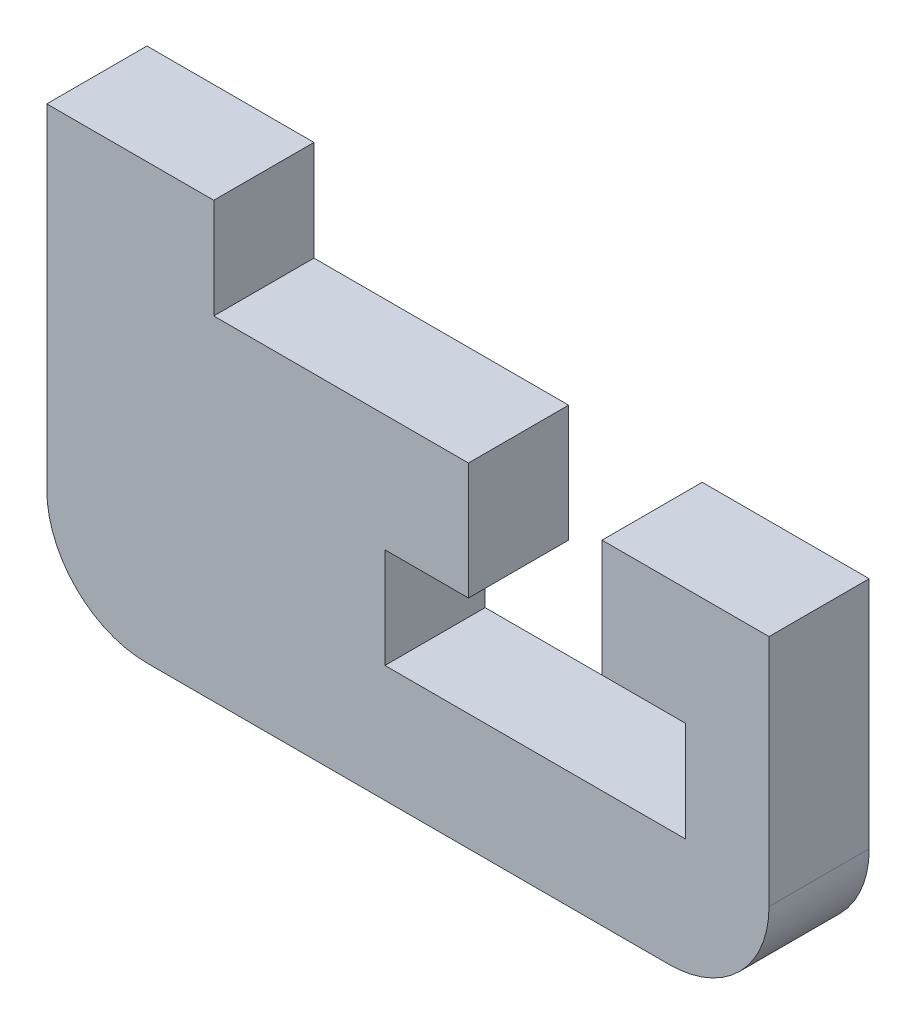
ISO-10303-21;
HEADER;
FILE_DESCRIPTION(('STEP AP214'),'2;1');
FILE_NAME('part.step','',(''),(''),'','','');
FILE_SCHEMA(('AUTOMOTIVE_DESIGN { 1 0 10303 214 1 1 1 1 }'));
ENDSEC;
DATA;
#1=APPLICATION_CONTEXT('core data for automotive mechanical design processes');
#2=APPLICATION_PROTOCOL_DEFINITION('international standard','automotive_design',2000,#1);
#3=PRODUCT_CONTEXT('',#1,'mechanical');
#4=PRODUCT('Part','Part','',(#3));
#5=PRODUCT_RELATED_PRODUCT_CATEGORY('part','',(#4));
#6=PRODUCT_DEFINITION_FORMATION('','',#4);
#7=PRODUCT_DEFINITION_CONTEXT('part definition',#1,'design');
#8=PRODUCT_DEFINITION('design','',#6,#7);
#9=PRODUCT_DEFINITION_SHAPE('','',#8);
#10=(LENGTH_UNIT() NAMED_UNIT(*) SI_UNIT(.MILLI.,.METRE.));
#11=(NAMED_UNIT(*) PLANE_ANGLE_UNIT() SI_UNIT($,.RADIAN.));
#12=(NAMED_UNIT(*) SI_UNIT($,.STERADIAN.) SOLID_ANGLE_UNIT());
#13=UNCERTAINTY_MEASURE_WITH_UNIT(LENGTH_MEASURE(1.E-05),#10,'distance_accuracy_value','');
#14=(GEOMETRIC_REPRESENTATION_CONTEXT(3) GLOBAL_UNCERTAINTY_ASSIGNED_CONTEXT((#13)) GLOBAL_UNIT_ASSIGNED_CONTEXT((#10,
#11,#12)) REPRESENTATION_CONTEXT('',''));
#15=CARTESIAN_POINT('',(0.,0.,0.));
#16=DIRECTION('',(0.,0.,1.));
#17=DIRECTION('',(1.,0.,0.));
#18=AXIS2_PLACEMENT_3D('',#15,#16,#17);
#19=CARTESIAN_POINT('',(-2.,12.0010272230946,3.));
#20=DIRECTION('',(0.,0.,-1.));
#21=DIRECTION('',(-1.,0.,0.));
#22=AXIS2_PLACEMENT_3D('',#19,#20,#21);
#23=CYLINDRICAL_SURFACE('',#22,3.);
#24=CARTESIAN_POINT('',(-2.,12.0010272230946,0.));
#25=DIRECTION('',(0.,0.,1.));
#26=DIRECTION('',(1.,0.,0.));
#27=AXIS2_PLACEMENT_3D('',#24,#25,#26);
#28=CIRCLE('',#27,3.);
#29=CARTESIAN_POINT('',(-5.,12.0010272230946,0.));
#30=VERTEX_POINT('',#29);
#31=CARTESIAN_POINT('',(-1.99999999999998,9.00102722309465,0.));
#32=VERTEX_POINT('',#31);
#33=EDGE_CURVE('E179',#30,#32,#28,.T.);
#34=ORIENTED_EDGE('',*,*,#33,.T.);
#35=DIRECTION('',(0.,0.,-1.));
#36=VECTOR('',#35,1.);
#37=CARTESIAN_POINT('',(-1.99999999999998,9.00102722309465,3.));
#38=LINE('',#37,#36);
#39=CARTESIAN_POINT('',(-1.99999999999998,9.00102722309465,3.));
#40=VERTEX_POINT('',#39);
#41=EDGE_CURVE('E11',#40,#32,#38,.T.);
#42=ORIENTED_EDGE('',*,*,#41,.F.);
#43=CARTESIAN_POINT('',(-2.,12.0010272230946,3.));
#44=DIRECTION('',(0.,0.,1.));
#45=DIRECTION('',(1.,0.,0.));
#46=AXIS2_PLACEMENT_3D('',#43,#44,#45);
#47=CIRCLE('',#46,3.);
#48=CARTESIAN_POINT('',(-5.,12.0010272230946,3.));
#49=VERTEX_POINT('',#48);
#50=EDGE_CURVE('E209',#49,#40,#47,.T.);
#51=ORIENTED_EDGE('',*,*,#50,.F.);
#52=DIRECTION('',(0.,0.,-1.));
#53=VECTOR('',#52,1.);
#54=CARTESIAN_POINT('',(-5.,12.0010272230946,3.));
#55=LINE('',#54,#53);
#56=EDGE_CURVE('E175',#49,#30,#55,.T.);
#57=ORIENTED_EDGE('',*,*,#56,.T.);
#58=EDGE_LOOP('',(#34,#42,#51,#57));
#59=FACE_BOUND('',#58,.T.);
#60=ADVANCED_FACE('F35',(#59),#23,.T.);
#61=CARTESIAN_POINT('',(13.625,9.00102722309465,3.));
#62=DIRECTION('',(0.,1.,0.));
#63=DIRECTION('',(0.,0.,1.));
#64=AXIS2_PLACEMENT_3D('',#61,#62,#63);
#65=PLANE('',#64);
#66=DIRECTION('',(1.,0.,0.));
#67=VECTOR('',#66,1.);
#68=CARTESIAN_POINT('',(13.625,9.00102722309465,0.));
#69=LINE('',#68,#67);
#70=CARTESIAN_POINT('',(13.625,9.00102722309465,0.));
#71=VERTEX_POINT('',#70);
#72=EDGE_CURVE('E182',#32,#71,#69,.T.);
#73=ORIENTED_EDGE('',*,*,#72,.T.);
#74=DIRECTION('',(0.,0.,-1.));
#75=VECTOR('',#74,1.);
#76=CARTESIAN_POINT('',(13.625,9.00102722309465,3.));
#77=LINE('',#76,#75);
#78=CARTESIAN_POINT('',(13.625,9.00102722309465,3.));
#79=VERTEX_POINT('',#78);
#80=EDGE_CURVE('E43',#79,#71,#77,.T.);
#81=ORIENTED_EDGE('',*,*,#80,.F.);
#82=DIRECTION('',(1.,0.,0.));
#83=VECTOR('',#82,1.);
#84=CARTESIAN_POINT('',(13.625,9.00102722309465,3.));
#85=LINE('',#84,#83);
#86=EDGE_CURVE('E118',#40,#79,#85,.T.);
#87=ORIENTED_EDGE('',*,*,#86,.F.);
#88=ORIENTED_EDGE('',*,*,#41,.T.);
#89=EDGE_LOOP('',(#73,#81,#87,#88));
#90=FACE_BOUND('',#89,.T.);
#91=ADVANCED_FACE('F307',(#90),#65,.F.);
#92=CARTESIAN_POINT('',(13.625,12.0010272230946,3.));
#93=DIRECTION('',(0.,0.,-1.));
#94=DIRECTION('',(-1.,0.,0.));
#95=AXIS2_PLACEMENT_3D('',#92,#93,#94);
#96=CYLINDRICAL_SURFACE('',#95,3.);
#97=CARTESIAN_POINT('',(13.625,12.0010272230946,0.));
#98=DIRECTION('',(0.,0.,1.));
#99=DIRECTION('',(-1.,0.,0.));
#100=AXIS2_PLACEMENT_3D('',#97,#98,#99);
#101=CIRCLE('',#100,3.);
#102=CARTESIAN_POINT('',(16.625,12.0010272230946,0.));
#103=VERTEX_POINT('',#102);
#104=EDGE_CURVE('E184',#71,#103,#101,.T.);
#105=ORIENTED_EDGE('',*,*,#104,.T.);
#106=DIRECTION('',(0.,0.,-1.));
#107=VECTOR('',#106,1.);
#108=CARTESIAN_POINT('',(16.625,12.0010272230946,3.));
#109=LINE('',#108,#107);
#110=CARTESIAN_POINT('',(16.625,12.0010272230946,3.));
#111=VERTEX_POINT('',#110);
#112=EDGE_CURVE('E240',#111,#103,#109,.T.);
#113=ORIENTED_EDGE('',*,*,#112,.F.);
#114=CARTESIAN_POINT('',(13.625,12.0010272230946,3.));
#115=DIRECTION('',(0.,0.,1.));
#116=DIRECTION('',(-1.,0.,0.));
#117=AXIS2_PLACEMENT_3D('',#114,#115,#116);
#118=CIRCLE('',#117,3.);
#119=EDGE_CURVE('E248',#79,#111,#118,.T.);
#120=ORIENTED_EDGE('',*,*,#119,.F.);
#121=ORIENTED_EDGE('',*,*,#80,.T.);
#122=EDGE_LOOP('',(#105,#113,#120,#121));
#123=FACE_BOUND('',#122,.T.);
#124=ADVANCED_FACE('F246',(#123),#96,.T.);
#125=CARTESIAN_POINT('',(16.625,19.0010272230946,3.));
#126=DIRECTION('',(-1.,0.,0.));
#127=DIRECTION('',(0.,-1.,0.));
#128=AXIS2_PLACEMENT_3D('',#125,#126,#127);
#129=PLANE('',#128);
#130=DIRECTION('',(0.,1.,0.));
#131=VECTOR('',#130,1.);
#132=CARTESIAN_POINT('',(16.625,19.0010272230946,0.));
#133=LINE('',#132,#131);
#134=CARTESIAN_POINT('',(16.625,19.0010272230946,0.));
#135=VERTEX_POINT('',#134);
#136=EDGE_CURVE('E186',#103,#135,#133,.T.);
#137=ORIENTED_EDGE('',*,*,#136,.T.);
#138=DIRECTION('',(0.,0.,-1.));
#139=VECTOR('',#138,1.);
#140=CARTESIAN_POINT('',(16.625,19.0010272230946,3.));
#141=LINE('',#140,#139);
#142=CARTESIAN_POINT('',(16.625,19.0010272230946,3.));
#143=VERTEX_POINT('',#142);
#144=EDGE_CURVE('E237',#143,#135,#141,.T.);
#145=ORIENTED_EDGE('',*,*,#144,.F.);
#146=DIRECTION('',(0.,1.,0.));
#147=VECTOR('',#146,1.);
#148=CARTESIAN_POINT('',(16.625,19.0010272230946,3.));
#149=LINE('',#148,#147);
#150=EDGE_CURVE('E266',#111,#143,#149,.T.);
#151=ORIENTED_EDGE('',*,*,#150,.F.);
#152=ORIENTED_EDGE('',*,*,#112,.T.);
#153=EDGE_LOOP('',(#137,#145,#151,#152));
#154=FACE_BOUND('',#153,.T.);
#155=ADVANCED_FACE('F257',(#154),#129,.F.);
#156=CARTESIAN_POINT('',(11.625,19.0010272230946,3.));
#157=DIRECTION('',(0.,-1.,0.));
#158=DIRECTION('',(0.,0.,-1.));
#159=AXIS2_PLACEMENT_3D('',#156,#157,#158);
#160=PLANE('',#159);
#161=DIRECTION('',(-1.,0.,0.));
#162=VECTOR('',#161,1.);
#163=CARTESIAN_POINT('',(11.625,19.0010272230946,0.));
#164=LINE('',#163,#162);
#165=CARTESIAN_POINT('',(11.625,19.0010272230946,0.));
#166=VERTEX_POINT('',#165);
#167=EDGE_CURVE('E188',#135,#166,#164,.T.);
#168=ORIENTED_EDGE('',*,*,#167,.T.);
#169=DIRECTION('',(0.,0.,-1.));
#170=VECTOR('',#169,1.);
#171=CARTESIAN_POINT('',(11.625,19.0010272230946,3.));
#172=LINE('',#171,#170);
#173=CARTESIAN_POINT('',(11.625,19.0010272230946,3.));
#174=VERTEX_POINT('',#173);
#175=EDGE_CURVE('E234',#174,#166,#172,.T.);
#176=ORIENTED_EDGE('',*,*,#175,.F.);
#177=DIRECTION('',(-1.,0.,0.));
#178=VECTOR('',#177,1.);
#179=CARTESIAN_POINT('',(11.625,19.0010272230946,3.));
#180=LINE('',#179,#178);
#181=EDGE_CURVE('E263',#143,#174,#180,.T.);
#182=ORIENTED_EDGE('',*,*,#181,.F.);
#183=ORIENTED_EDGE('',*,*,#144,.T.);
#184=EDGE_LOOP('',(#168,#176,#182,#183));
#185=FACE_BOUND('',#184,.T.);
#186=ADVANCED_FACE('F261',(#185),#160,.F.);
#187=CARTESIAN_POINT('',(11.625,19.0010272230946,3.));
#188=DIRECTION('',(1.,0.,0.));
#189=DIRECTION('',(0.,0.,-1.));
#190=AXIS2_PLACEMENT_3D('',#187,#188,#189);
#191=PLANE('',#190);
#192=DIRECTION('',(0.,-1.,0.));
#193=VECTOR('',#192,1.);
#194=CARTESIAN_POINT('',(11.625,19.0010272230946,0.));
#195=LINE('',#194,#193);
#196=CARTESIAN_POINT('',(11.625,15.5010272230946,0.));
#197=VERTEX_POINT('',#196);
#198=EDGE_CURVE('E190',#166,#197,#195,.T.);
#199=ORIENTED_EDGE('',*,*,#198,.T.);
#200=DIRECTION('',(0.,0.,-1.));
#201=VECTOR('',#200,1.);
#202=CARTESIAN_POINT('',(11.625,15.5010272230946,3.));
#203=LINE('',#202,#201);
#204=CARTESIAN_POINT('',(11.625,15.5010272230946,3.));
#205=VERTEX_POINT('',#204);
#206=EDGE_CURVE('E231',#205,#197,#203,.T.);
#207=ORIENTED_EDGE('',*,*,#206,.F.);
#208=DIRECTION('',(0.,-1.,0.));
#209=VECTOR('',#208,1.);
#210=CARTESIAN_POINT('',(11.625,19.0010272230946,3.));
#211=LINE('',#210,#209);
#212=EDGE_CURVE('E265',#174,#205,#211,.T.);
#213=ORIENTED_EDGE('',*,*,#212,.F.);
#214=ORIENTED_EDGE('',*,*,#175,.T.);
#215=EDGE_LOOP('',(#199,#207,#213,#214));
#216=FACE_BOUND('',#215,.T.);
#217=ADVANCED_FACE('F320',(#216),#191,.F.);
#218=CARTESIAN_POINT('',(11.625,15.5010272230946,3.));
#219=DIRECTION('',(0.,1.,0.));
#220=DIRECTION('',(0.,0.,1.));
#221=AXIS2_PLACEMENT_3D('',#218,#219,#220);
#222=PLANE('',#221);
#223=DIRECTION('',(1.,0.,0.));
#224=VECTOR('',#223,1.);
#225=CARTESIAN_POINT('',(11.625,15.5010272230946,0.));
#226=LINE('',#225,#224);
#227=CARTESIAN_POINT('',(14.125,15.5010272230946,0.));
#228=VERTEX_POINT('',#227);
#229=EDGE_CURVE('E192',#197,#228,#226,.T.);
#230=ORIENTED_EDGE('',*,*,#229,.T.);
#231=DIRECTION('',(0.,0.,-1.));
#232=VECTOR('',#231,1.);
#233=CARTESIAN_POINT('',(14.125,15.5010272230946,3.));
#234=LINE('',#233,#232);
#235=CARTESIAN_POINT('',(14.125,15.5010272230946,3.));
#236=VERTEX_POINT('',#235);
#237=EDGE_CURVE('E228',#236,#228,#234,.T.);
#238=ORIENTED_EDGE('',*,*,#237,.F.);
#239=DIRECTION('',(1.,0.,0.));
#240=VECTOR('',#239,1.);
#241=CARTESIAN_POINT('',(11.625,15.5010272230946,3.));
#242=LINE('',#241,#240);
#243=EDGE_CURVE('E268',#205,#236,#242,.T.);
#244=ORIENTED_EDGE('',*,*,#243,.F.);
#245=ORIENTED_EDGE('',*,*,#206,.T.);
#246=EDGE_LOOP('',(#230,#238,#244,#245));
#247=FACE_BOUND('',#246,.T.);
#248=ADVANCED_FACE('F323',(#247),#222,.F.);
#249=CARTESIAN_POINT('',(14.125,15.5010272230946,3.));
#250=DIRECTION('',(1.,0.,0.));
#251=DIRECTION('',(0.,0.,-1.));
#252=AXIS2_PLACEMENT_3D('',#249,#250,#251);
#253=PLANE('',#252);
#254=DIRECTION('',(0.,-1.,0.));
#255=VECTOR('',#254,1.);
#256=CARTESIAN_POINT('',(14.125,15.5010272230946,0.));
#257=LINE('',#256,#255);
#258=CARTESIAN_POINT('',(14.125,12.5010272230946,0.));
#259=VERTEX_POINT('',#258);
#260=EDGE_CURVE('E194',#228,#259,#257,.T.);
#261=ORIENTED_EDGE('',*,*,#260,.T.);
#262=DIRECTION('',(0.,0.,-1.));
#263=VECTOR('',#262,1.);
#264=CARTESIAN_POINT('',(14.125,12.5010272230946,3.));
#265=LINE('',#264,#263);
#266=CARTESIAN_POINT('',(14.125,12.5010272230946,3.));
#267=VERTEX_POINT('',#266);
#268=EDGE_CURVE('E225',#267,#259,#265,.T.);
#269=ORIENTED_EDGE('',*,*,#268,.F.);
#270=DIRECTION('',(0.,-1.,0.));
#271=VECTOR('',#270,1.);
#272=CARTESIAN_POINT('',(14.125,15.5010272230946,3.));
#273=LINE('',#272,#271);
#274=EDGE_CURVE('E274',#236,#267,#273,.T.);
#275=ORIENTED_EDGE('',*,*,#274,.F.);
#276=ORIENTED_EDGE('',*,*,#237,.T.);
#277=EDGE_LOOP('',(#261,#269,#275,#276));
#278=FACE_BOUND('',#277,.T.);
#279=ADVANCED_FACE('F327',(#278),#253,.F.);
#280=CARTESIAN_POINT('',(14.125,12.5010272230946,3.));
#281=DIRECTION('',(0.,-1.,0.));
#282=DIRECTION('',(1.,0.,0.));
#283=AXIS2_PLACEMENT_3D('',#280,#281,#282);
#284=PLANE('',#283);
#285=DIRECTION('',(-1.,0.,0.));
#286=VECTOR('',#285,1.);
#287=CARTESIAN_POINT('',(14.125,12.5010272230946,0.));
#288=LINE('',#287,#286);
#289=CARTESIAN_POINT('',(5.125,12.5010272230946,0.));
#290=VERTEX_POINT('',#289);
#291=EDGE_CURVE('E196',#259,#290,#288,.T.);
#292=ORIENTED_EDGE('',*,*,#291,.T.);
#293=DIRECTION('',(0.,0.,-1.));
#294=VECTOR('',#293,1.);
#295=CARTESIAN_POINT('',(5.125,12.5010272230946,3.));
#296=LINE('',#295,#294);
#297=CARTESIAN_POINT('',(5.125,12.5010272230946,3.));
#298=VERTEX_POINT('',#297);
#299=EDGE_CURVE('E222',#298,#290,#296,.T.);
#300=ORIENTED_EDGE('',*,*,#299,.F.);
#301=DIRECTION('',(-1.,0.,0.));
#302=VECTOR('',#301,1.);
#303=CARTESIAN_POINT('',(14.125,12.5010272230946,3.));
#304=LINE('',#303,#302);
#305=EDGE_CURVE('E276',#267,#298,#304,.T.);
#306=ORIENTED_EDGE('',*,*,#305,.F.);
#307=ORIENTED_EDGE('',*,*,#268,.T.);
#308=EDGE_LOOP('',(#292,#300,#306,#307));
#309=FACE_BOUND('',#308,.T.);
#310=ADVANCED_FACE('F331',(#309),#284,.F.);
#311=CARTESIAN_POINT('',(5.125,12.5010272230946,3.));
#312=DIRECTION('',(-1.,0.,0.));
#313=DIRECTION('',(0.,0.,1.));
#314=AXIS2_PLACEMENT_3D('',#311,#312,#313);
#315=PLANE('',#314);
#316=DIRECTION('',(0.,1.,0.));
#317=VECTOR('',#316,1.);
#318=CARTESIAN_POINT('',(5.125,12.5010272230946,0.));
#319=LINE('',#318,#317);
#320=CARTESIAN_POINT('',(5.125,15.5010272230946,0.));
#321=VERTEX_POINT('',#320);
#322=EDGE_CURVE('E198',#290,#321,#319,.T.);
#323=ORIENTED_EDGE('',*,*,#322,.T.);
#324=DIRECTION('',(0.,0.,-1.));
#325=VECTOR('',#324,1.);
#326=CARTESIAN_POINT('',(5.125,15.5010272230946,3.));
#327=LINE('',#326,#325);
#328=CARTESIAN_POINT('',(5.125,15.5010272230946,3.));
#329=VERTEX_POINT('',#328);
#330=EDGE_CURVE('E219',#329,#321,#327,.T.);
#331=ORIENTED_EDGE('',*,*,#330,.F.);
#332=DIRECTION('',(0.,1.,0.));
#333=VECTOR('',#332,1.);
#334=CARTESIAN_POINT('',(5.125,12.5010272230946,3.));
#335=LINE('',#334,#333);
#336=EDGE_CURVE('E278',#298,#329,#335,.T.);
#337=ORIENTED_EDGE('',*,*,#336,.F.);
#338=ORIENTED_EDGE('',*,*,#299,.T.);
#339=EDGE_LOOP('',(#323,#331,#337,#338));
#340=FACE_BOUND('',#339,.T.);
#341=ADVANCED_FACE('F335',(#340),#315,.F.);
#342=CARTESIAN_POINT('',(5.125,15.5010272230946,3.));
#343=DIRECTION('',(0.,1.,0.));
#344=DIRECTION('',(0.,0.,1.));
#345=AXIS2_PLACEMENT_3D('',#342,#343,#344);
#346=PLANE('',#345);
#347=DIRECTION('',(1.,0.,0.));
#348=VECTOR('',#347,1.);
#349=CARTESIAN_POINT('',(5.125,15.5010272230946,0.));
#350=LINE('',#349,#348);
#351=CARTESIAN_POINT('',(7.625,15.5010272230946,0.));
#352=VERTEX_POINT('',#351);
#353=EDGE_CURVE('E200',#321,#352,#350,.T.);
#354=ORIENTED_EDGE('',*,*,#353,.T.);
#355=DIRECTION('',(0.,0.,-1.));
#356=VECTOR('',#355,1.);
#357=CARTESIAN_POINT('',(7.625,15.5010272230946,3.));
#358=LINE('',#357,#356);
#359=CARTESIAN_POINT('',(7.625,15.5010272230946,3.));
#360=VERTEX_POINT('',#359);
#361=EDGE_CURVE('E216',#360,#352,#358,.T.);
#362=ORIENTED_EDGE('',*,*,#361,.F.);
#363=DIRECTION('',(1.,0.,0.));
#364=VECTOR('',#363,1.);
#365=CARTESIAN_POINT('',(5.125,15.5010272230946,3.));
#366=LINE('',#365,#364);
#367=EDGE_CURVE('E280',#329,#360,#366,.T.);
#368=ORIENTED_EDGE('',*,*,#367,.F.);
#369=ORIENTED_EDGE('',*,*,#330,.T.);
#370=EDGE_LOOP('',(#354,#362,#368,#369));
#371=FACE_BOUND('',#370,.T.);
#372=ADVANCED_FACE('F339',(#371),#346,.F.);
#373=CARTESIAN_POINT('',(7.625,15.5010272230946,3.));
#374=DIRECTION('',(-1.,0.,0.));
#375=DIRECTION('',(0.,0.,1.));
#376=AXIS2_PLACEMENT_3D('',#373,#374,#375);
#377=PLANE('',#376);
#378=DIRECTION('',(0.,1.,0.));
#379=VECTOR('',#378,1.);
#380=CARTESIAN_POINT('',(7.625,15.5010272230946,0.));
#381=LINE('',#380,#379);
#382=CARTESIAN_POINT('',(7.625,19.0010272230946,0.));
#383=VERTEX_POINT('',#382);
#384=EDGE_CURVE('E202',#352,#383,#381,.T.);
#385=ORIENTED_EDGE('',*,*,#384,.T.);
#386=DIRECTION('',(0.,0.,-1.));
#387=VECTOR('',#386,1.);
#388=CARTESIAN_POINT('',(7.625,19.0010272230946,3.));
#389=LINE('',#388,#387);
#390=CARTESIAN_POINT('',(7.625,19.0010272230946,3.));
#391=VERTEX_POINT('',#390);
#392=EDGE_CURVE('E213',#391,#383,#389,.T.);
#393=ORIENTED_EDGE('',*,*,#392,.F.);
#394=DIRECTION('',(0.,1.,0.));
#395=VECTOR('',#394,1.);
#396=CARTESIAN_POINT('',(7.625,15.5010272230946,3.));
#397=LINE('',#396,#395);
#398=EDGE_CURVE('E282',#360,#391,#397,.T.);
#399=ORIENTED_EDGE('',*,*,#398,.F.);
#400=ORIENTED_EDGE('',*,*,#361,.T.);
#401=EDGE_LOOP('',(#385,#393,#399,#400));
#402=FACE_BOUND('',#401,.T.);
#403=ADVANCED_FACE('F288',(#402),#377,.F.);
#404=CARTESIAN_POINT('',(7.625,19.0010272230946,3.));
#405=DIRECTION('',(0.,-1.,0.));
#406=DIRECTION('',(0.,0.,-1.));
#407=AXIS2_PLACEMENT_3D('',#404,#405,#406);
#408=PLANE('',#407);
#409=DIRECTION('',(-1.,0.,0.));
#410=VECTOR('',#409,1.);
#411=CARTESIAN_POINT('',(7.625,19.0010272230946,0.));
#412=LINE('',#411,#410);
#413=CARTESIAN_POINT('',(0.,19.0010272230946,0.));
#414=VERTEX_POINT('',#413);
#415=EDGE_CURVE('E204',#383,#414,#412,.T.);
#416=ORIENTED_EDGE('',*,*,#415,.T.);
#417=DIRECTION('',(0.,0.,-1.));
#418=VECTOR('',#417,1.);
#419=CARTESIAN_POINT('',(0.,19.0010272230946,3.));
#420=LINE('',#419,#418);
#421=CARTESIAN_POINT('',(0.,19.0010272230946,3.));
#422=VERTEX_POINT('',#421);
#423=EDGE_CURVE('E170',#422,#414,#420,.T.);
#424=ORIENTED_EDGE('',*,*,#423,.F.);
#425=DIRECTION('',(-1.,0.,0.));
#426=VECTOR('',#425,1.);
#427=CARTESIAN_POINT('',(7.625,19.0010272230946,3.));
#428=LINE('',#427,#426);
#429=EDGE_CURVE('E161',#391,#422,#428,.T.);
#430=ORIENTED_EDGE('',*,*,#429,.F.);
#431=ORIENTED_EDGE('',*,*,#392,.T.);
#432=EDGE_LOOP('',(#416,#424,#430,#431));
#433=FACE_BOUND('',#432,.T.);
#434=ADVANCED_FACE('F292',(#433),#408,.F.);
#435=CARTESIAN_POINT('',(0.,19.0010272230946,3.));
#436=DIRECTION('',(-1.,0.,0.));
#437=DIRECTION('',(0.,0.,1.));
#438=AXIS2_PLACEMENT_3D('',#435,#436,#437);
#439=PLANE('',#438);
#440=DIRECTION('',(0.,1.,0.));
#441=VECTOR('',#440,1.);
#442=CARTESIAN_POINT('',(0.,19.0010272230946,0.));
#443=LINE('',#442,#441);
#444=CARTESIAN_POINT('',(0.,22.0010272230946,0.));
#445=VERTEX_POINT('',#444);
#446=EDGE_CURVE('E169',#414,#445,#443,.T.);
#447=ORIENTED_EDGE('',*,*,#446,.T.);
#448=DIRECTION('',(0.,0.,-1.));
#449=VECTOR('',#448,1.);
#450=CARTESIAN_POINT('',(0.,22.0010272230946,3.));
#451=LINE('',#450,#449);
#452=CARTESIAN_POINT('',(0.,22.0010272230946,3.));
#453=VERTEX_POINT('',#452);
#454=EDGE_CURVE('E166',#453,#445,#451,.T.);
#455=ORIENTED_EDGE('',*,*,#454,.F.);
#456=DIRECTION('',(0.,1.,0.));
#457=VECTOR('',#456,1.);
#458=CARTESIAN_POINT('',(0.,19.0010272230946,3.));
#459=LINE('',#458,#457);
#460=EDGE_CURVE('E155',#422,#453,#459,.T.);
#461=ORIENTED_EDGE('',*,*,#460,.F.);
#462=ORIENTED_EDGE('',*,*,#423,.T.);
#463=EDGE_LOOP('',(#447,#455,#461,#462));
#464=FACE_BOUND('',#463,.T.);
#465=ADVANCED_FACE('F167',(#464),#439,.F.);
#466=CARTESIAN_POINT('',(0.,22.0010272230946,3.));
#467=DIRECTION('',(0.,-1.,0.));
#468=DIRECTION('',(0.,0.,-1.));
#469=AXIS2_PLACEMENT_3D('',#466,#467,#468);
#470=PLANE('',#469);
#471=DIRECTION('',(-1.,0.,0.));
#472=VECTOR('',#471,1.);
#473=CARTESIAN_POINT('',(0.,22.0010272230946,0.));
#474=LINE('',#473,#472);
#475=CARTESIAN_POINT('',(-5.,22.0010272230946,0.));
#476=VERTEX_POINT('',#475);
#477=EDGE_CURVE('E104',#445,#476,#474,.T.);
#478=ORIENTED_EDGE('',*,*,#477,.T.);
#479=DIRECTION('',(0.,0.,-1.));
#480=VECTOR('',#479,1.);
#481=CARTESIAN_POINT('',(-5.,22.0010272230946,3.));
#482=LINE('',#481,#480);
#483=CARTESIAN_POINT('',(-5.,22.0010272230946,3.));
#484=VERTEX_POINT('',#483);
#485=EDGE_CURVE('E171',#484,#476,#482,.T.);
#486=ORIENTED_EDGE('',*,*,#485,.F.);
#487=DIRECTION('',(-1.,0.,0.));
#488=VECTOR('',#487,1.);
#489=CARTESIAN_POINT('',(0.,22.0010272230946,3.));
#490=LINE('',#489,#488);
#491=EDGE_CURVE('E159',#453,#484,#490,.T.);
#492=ORIENTED_EDGE('',*,*,#491,.F.);
#493=ORIENTED_EDGE('',*,*,#454,.T.);
#494=EDGE_LOOP('',(#478,#486,#492,#493));
#495=FACE_BOUND('',#494,.T.);
#496=ADVANCED_FACE('F173',(#495),#470,.F.);
#497=CARTESIAN_POINT('',(-5.,22.0010272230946,3.));
#498=DIRECTION('',(1.,0.,0.));
#499=DIRECTION('',(0.,1.,0.));
#500=AXIS2_PLACEMENT_3D('',#497,#498,#499);
#501=PLANE('',#500);
#502=DIRECTION('',(0.,-1.,0.));
#503=VECTOR('',#502,1.);
#504=CARTESIAN_POINT('',(-5.,22.0010272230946,0.));
#505=LINE('',#504,#503);
#506=EDGE_CURVE('E110',#476,#30,#505,.T.);
#507=ORIENTED_EDGE('',*,*,#506,.T.);
#508=ORIENTED_EDGE('',*,*,#56,.F.);
#509=DIRECTION('',(0.,-1.,0.));
#510=VECTOR('',#509,1.);
#511=CARTESIAN_POINT('',(-5.,22.0010272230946,3.));
#512=LINE('',#511,#510);
#513=EDGE_CURVE('E51',#484,#49,#512,.T.);
#514=ORIENTED_EDGE('',*,*,#513,.F.);
#515=ORIENTED_EDGE('',*,*,#485,.T.);
#516=EDGE_LOOP('',(#507,#508,#514,#515));
#517=FACE_BOUND('',#516,.T.);
#518=ADVANCED_FACE('F296',(#517),#501,.F.);
#519=CARTESIAN_POINT('',(-2.,12.0010272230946,3.));
#520=DIRECTION('',(0.,0.,1.));
#521=DIRECTION('',(1.,0.,0.));
#522=AXIS2_PLACEMENT_3D('',#519,#520,#521);
#523=PLANE('',#522);
#524=ORIENTED_EDGE('',*,*,#50,.T.);
#525=ORIENTED_EDGE('',*,*,#86,.T.);
#526=ORIENTED_EDGE('',*,*,#119,.T.);
#527=ORIENTED_EDGE('',*,*,#150,.T.);
#528=ORIENTED_EDGE('',*,*,#181,.T.);
#529=ORIENTED_EDGE('',*,*,#212,.T.);
#530=ORIENTED_EDGE('',*,*,#243,.T.);
#531=ORIENTED_EDGE('',*,*,#274,.T.);
#532=ORIENTED_EDGE('',*,*,#305,.T.);
#533=ORIENTED_EDGE('',*,*,#336,.T.);
#534=ORIENTED_EDGE('',*,*,#367,.T.);
#535=ORIENTED_EDGE('',*,*,#398,.T.);
#536=ORIENTED_EDGE('',*,*,#429,.T.);
#537=ORIENTED_EDGE('',*,*,#460,.T.);
#538=ORIENTED_EDGE('',*,*,#491,.T.);
#539=ORIENTED_EDGE('',*,*,#513,.T.);
#540=EDGE_LOOP('',(#524,#525,#526,#527,#528,#529,#530,#531,#532,#533,#534,#535,#536,#537,#538,#539));
#541=FACE_BOUND('',#540,.T.);
#542=ADVANCED_FACE('F157',(#541),#523,.T.);
#543=CARTESIAN_POINT('',(-2.,12.0010272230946,0.));
#544=DIRECTION('',(0.,0.,1.));
#545=DIRECTION('',(1.,0.,0.));
#546=AXIS2_PLACEMENT_3D('',#543,#544,#545);
#547=PLANE('',#546);
#548=ORIENTED_EDGE('',*,*,#33,.F.);
#549=ORIENTED_EDGE('',*,*,#506,.F.);
#550=ORIENTED_EDGE('',*,*,#477,.F.);
#551=ORIENTED_EDGE('',*,*,#446,.F.);
#552=ORIENTED_EDGE('',*,*,#415,.F.);
#553=ORIENTED_EDGE('',*,*,#384,.F.);
#554=ORIENTED_EDGE('',*,*,#353,.F.);
#555=ORIENTED_EDGE('',*,*,#322,.F.);
#556=ORIENTED_EDGE('',*,*,#291,.F.);
#557=ORIENTED_EDGE('',*,*,#260,.F.);
#558=ORIENTED_EDGE('',*,*,#229,.F.);
#559=ORIENTED_EDGE('',*,*,#198,.F.);
#560=ORIENTED_EDGE('',*,*,#167,.F.);
#561=ORIENTED_EDGE('',*,*,#136,.F.);
#562=ORIENTED_EDGE('',*,*,#104,.F.);
#563=ORIENTED_EDGE('',*,*,#72,.F.);
#564=EDGE_LOOP('',(#548,#549,#550,#551,#552,#553,#554,#555,#556,#557,#558,#559,#560,#561,#562,#563));
#565=FACE_BOUND('',#564,.T.);
#566=ADVANCED_FACE('F252',(#565),#547,.F.);
#567=CLOSED_SHELL('',(#60,#91,#124,#155,#186,#217,#248,#279,#310,#341,#372,#403,#434,#465,#496,
#518,#542,#566));
#568=MANIFOLD_SOLID_BREP('B2',#567);
#569=ADVANCED_BREP_SHAPE_REPRESENTATION('',(#18,#568),#14);
#570=SHAPE_DEFINITION_REPRESENTATION(#9,#569);
ENDSEC;
END-ISO-10303-21;
